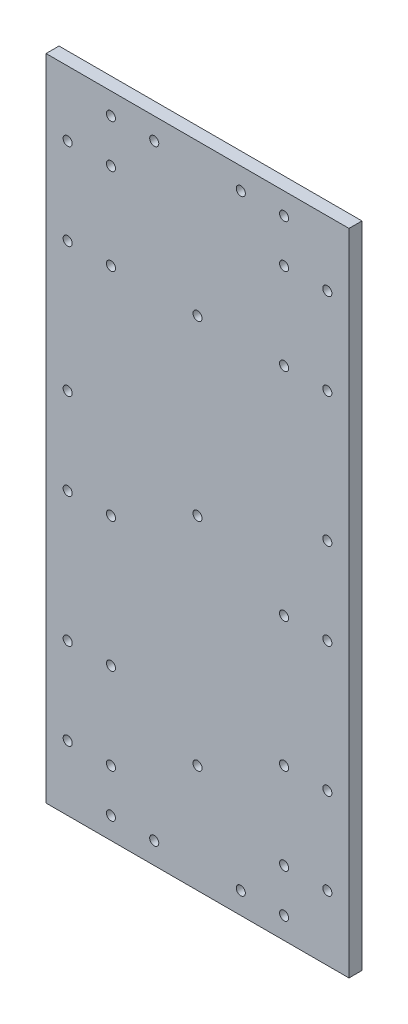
ISO-10303-21;
HEADER;
FILE_DESCRIPTION(('STEP AP214'),'2;1');
FILE_NAME('part.step','',(''),(''),'','','');
FILE_SCHEMA(('AUTOMOTIVE_DESIGN { 1 0 10303 214 1 1 1 1 }'));
ENDSEC;
DATA;
#1=APPLICATION_CONTEXT('core data for automotive mechanical design processes');
#2=APPLICATION_PROTOCOL_DEFINITION('international standard','automotive_design',2000,#1);
#3=PRODUCT_CONTEXT('',#1,'mechanical');
#4=PRODUCT('Part','Part','',(#3));
#5=PRODUCT_RELATED_PRODUCT_CATEGORY('part','',(#4));
#6=PRODUCT_DEFINITION_FORMATION('','',#4);
#7=PRODUCT_DEFINITION_CONTEXT('part definition',#1,'design');
#8=PRODUCT_DEFINITION('design','',#6,#7);
#9=PRODUCT_DEFINITION_SHAPE('','',#8);
#10=(LENGTH_UNIT() NAMED_UNIT(*) SI_UNIT(.MILLI.,.METRE.));
#11=(NAMED_UNIT(*) PLANE_ANGLE_UNIT() SI_UNIT($,.RADIAN.));
#12=(NAMED_UNIT(*) SI_UNIT($,.STERADIAN.) SOLID_ANGLE_UNIT());
#13=UNCERTAINTY_MEASURE_WITH_UNIT(LENGTH_MEASURE(1.E-05),#10,'distance_accuracy_value','');
#14=(GEOMETRIC_REPRESENTATION_CONTEXT(3) GLOBAL_UNCERTAINTY_ASSIGNED_CONTEXT((#13)) GLOBAL_UNIT_ASSIGNED_CONTEXT((#10,
#11,#12)) REPRESENTATION_CONTEXT('',''));
#15=CARTESIAN_POINT('',(0.,0.,0.));
#16=DIRECTION('',(0.,0.,1.));
#17=DIRECTION('',(1.,0.,0.));
#18=AXIS2_PLACEMENT_3D('',#15,#16,#17);
#19=CARTESIAN_POINT('',(0.,0.,6.));
#20=DIRECTION('',(0.,0.,-1.));
#21=DIRECTION('',(-1.,0.,0.));
#22=AXIS2_PLACEMENT_3D('',#19,#20,#21);
#23=PLANE('',#22);
#24=CARTESIAN_POINT('',(89.999999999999,289.999999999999,6.));
#25=DIRECTION('',(0.,0.,1.));
#26=DIRECTION('',(1.,0.,0.));
#27=AXIS2_PLACEMENT_3D('',#24,#25,#26);
#28=CIRCLE('',#27,2.1);
#29=CARTESIAN_POINT('',(92.099999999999,289.999999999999,6.));
#30=VERTEX_POINT('',#29);
#31=EDGE_CURVE('E274',#30,#30,#28,.T.);
#32=ORIENTED_EDGE('',*,*,#31,.F.);
#33=EDGE_LOOP('',(#32));
#34=FACE_BOUND('',#33,.T.);
#35=CARTESIAN_POINT('',(129.999999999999,270.,6.));
#36=DIRECTION('',(0.,0.,1.));
#37=DIRECTION('',(1.,0.,0.));
#38=AXIS2_PLACEMENT_3D('',#35,#36,#37);
#39=CIRCLE('',#38,2.09999999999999);
#40=CARTESIAN_POINT('',(132.099999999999,270.,6.));
#41=VERTEX_POINT('',#40);
#42=EDGE_CURVE('E276',#41,#41,#39,.T.);
#43=ORIENTED_EDGE('',*,*,#42,.F.);
#44=EDGE_LOOP('',(#43));
#45=FACE_BOUND('',#44,.T.);
#46=CARTESIAN_POINT('',(109.999999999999,270.,6.));
#47=DIRECTION('',(0.,0.,1.));
#48=DIRECTION('',(1.,0.,0.));
#49=AXIS2_PLACEMENT_3D('',#46,#47,#48);
#50=CIRCLE('',#49,2.1);
#51=CARTESIAN_POINT('',(112.099999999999,270.,6.));
#52=VERTEX_POINT('',#51);
#53=EDGE_CURVE('E284',#52,#52,#50,.T.);
#54=ORIENTED_EDGE('',*,*,#53,.F.);
#55=EDGE_LOOP('',(#54));
#56=FACE_BOUND('',#55,.T.);
#57=CARTESIAN_POINT('',(129.999999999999,230.,6.));
#58=DIRECTION('',(0.,0.,1.));
#59=DIRECTION('',(1.,0.,0.));
#60=AXIS2_PLACEMENT_3D('',#57,#58,#59);
#61=CIRCLE('',#60,2.09999999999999);
#62=CARTESIAN_POINT('',(132.099999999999,230.,6.));
#63=VERTEX_POINT('',#62);
#64=EDGE_CURVE('E296',#63,#63,#61,.T.);
#65=ORIENTED_EDGE('',*,*,#64,.F.);
#66=EDGE_LOOP('',(#65));
#67=FACE_BOUND('',#66,.T.);
#68=CARTESIAN_POINT('',(29.9999999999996,130.,6.));
#69=DIRECTION('',(0.,0.,1.));
#70=DIRECTION('',(1.,0.,0.));
#71=AXIS2_PLACEMENT_3D('',#68,#69,#70);
#72=CIRCLE('',#71,2.1);
#73=CARTESIAN_POINT('',(32.0999999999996,130.,6.));
#74=VERTEX_POINT('',#73);
#75=EDGE_CURVE('E308',#74,#74,#72,.T.);
#76=ORIENTED_EDGE('',*,*,#75,.F.);
#77=EDGE_LOOP('',(#76));
#78=FACE_BOUND('',#77,.T.);
#79=CARTESIAN_POINT('',(110.,130.,6.));
#80=DIRECTION('',(0.,0.,1.));
#81=DIRECTION('',(1.,0.,0.));
#82=AXIS2_PLACEMENT_3D('',#79,#80,#81);
#83=CIRCLE('',#82,2.1);
#84=CARTESIAN_POINT('',(112.1,130.,6.));
#85=VERTEX_POINT('',#84);
#86=EDGE_CURVE('E314',#85,#85,#83,.T.);
#87=ORIENTED_EDGE('',*,*,#86,.F.);
#88=EDGE_LOOP('',(#87));
#89=FACE_BOUND('',#88,.T.);
#90=CARTESIAN_POINT('',(9.99999999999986,70.,6.));
#91=DIRECTION('',(0.,0.,1.));
#92=DIRECTION('',(1.,0.,0.));
#93=AXIS2_PLACEMENT_3D('',#90,#91,#92);
#94=CIRCLE('',#93,2.1);
#95=CARTESIAN_POINT('',(12.0999999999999,70.,6.));
#96=VERTEX_POINT('',#95);
#97=EDGE_CURVE('E320',#96,#96,#94,.T.);
#98=ORIENTED_EDGE('',*,*,#97,.F.);
#99=EDGE_LOOP('',(#98));
#100=FACE_BOUND('',#99,.T.);
#101=CARTESIAN_POINT('',(130.,70.,6.));
#102=DIRECTION('',(0.,0.,1.));
#103=DIRECTION('',(1.,0.,0.));
#104=AXIS2_PLACEMENT_3D('',#101,#102,#103);
#105=CIRCLE('',#104,2.09999999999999);
#106=CARTESIAN_POINT('',(132.1,70.,6.));
#107=VERTEX_POINT('',#106);
#108=EDGE_CURVE('E326',#107,#107,#105,.T.);
#109=ORIENTED_EDGE('',*,*,#108,.F.);
#110=EDGE_LOOP('',(#109));
#111=FACE_BOUND('',#110,.T.);
#112=CARTESIAN_POINT('',(69.9999999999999,50.,6.));
#113=DIRECTION('',(0.,0.,1.));
#114=DIRECTION('',(1.,0.,0.));
#115=AXIS2_PLACEMENT_3D('',#112,#113,#114);
#116=CIRCLE('',#115,2.1);
#117=CARTESIAN_POINT('',(72.0999999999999,50.,6.));
#118=VERTEX_POINT('',#117);
#119=EDGE_CURVE('E332',#118,#118,#116,.T.);
#120=ORIENTED_EDGE('',*,*,#119,.F.);
#121=EDGE_LOOP('',(#120));
#122=FACE_BOUND('',#121,.T.);
#123=CARTESIAN_POINT('',(10.,30.,6.));
#124=DIRECTION('',(0.,0.,1.));
#125=DIRECTION('',(1.,0.,0.));
#126=AXIS2_PLACEMENT_3D('',#123,#124,#125);
#127=CIRCLE('',#126,2.1);
#128=CARTESIAN_POINT('',(12.1,30.,6.));
#129=VERTEX_POINT('',#128);
#130=EDGE_CURVE('E338',#129,#129,#127,.T.);
#131=ORIENTED_EDGE('',*,*,#130,.F.);
#132=EDGE_LOOP('',(#131));
#133=FACE_BOUND('',#132,.T.);
#134=CARTESIAN_POINT('',(130.,30.,6.));
#135=DIRECTION('',(0.,0.,1.));
#136=DIRECTION('',(1.,0.,0.));
#137=AXIS2_PLACEMENT_3D('',#134,#135,#136);
#138=CIRCLE('',#137,2.09999999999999);
#139=CARTESIAN_POINT('',(132.1,30.,6.));
#140=VERTEX_POINT('',#139);
#141=EDGE_CURVE('E344',#140,#140,#138,.T.);
#142=ORIENTED_EDGE('',*,*,#141,.F.);
#143=EDGE_LOOP('',(#142));
#144=FACE_BOUND('',#143,.T.);
#145=CARTESIAN_POINT('',(110.,10.,6.));
#146=DIRECTION('',(0.,0.,1.));
#147=DIRECTION('',(1.,0.,0.));
#148=AXIS2_PLACEMENT_3D('',#145,#146,#147);
#149=CIRCLE('',#148,2.1);
#150=CARTESIAN_POINT('',(112.1,10.,6.));
#151=VERTEX_POINT('',#150);
#152=EDGE_CURVE('E350',#151,#151,#149,.T.);
#153=ORIENTED_EDGE('',*,*,#152,.F.);
#154=EDGE_LOOP('',(#153));
#155=FACE_BOUND('',#154,.T.);
#156=CARTESIAN_POINT('',(49.9999999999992,289.999999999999,6.));
#157=DIRECTION('',(0.,0.,1.));
#158=DIRECTION('',(1.,0.,0.));
#159=AXIS2_PLACEMENT_3D('',#156,#157,#158);
#160=CIRCLE('',#159,2.1);
#161=CARTESIAN_POINT('',(52.0999999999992,289.999999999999,6.));
#162=VERTEX_POINT('',#161);
#163=EDGE_CURVE('E356',#162,#162,#160,.T.);
#164=ORIENTED_EDGE('',*,*,#163,.F.);
#165=EDGE_LOOP('',(#164));
#166=FACE_BOUND('',#165,.T.);
#167=CARTESIAN_POINT('',(29.9999999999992,230.,6.));
#168=DIRECTION('',(0.,0.,1.));
#169=DIRECTION('',(1.,0.,0.));
#170=AXIS2_PLACEMENT_3D('',#167,#168,#169);
#171=CIRCLE('',#170,2.1);
#172=CARTESIAN_POINT('',(32.0999999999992,230.,6.));
#173=VERTEX_POINT('',#172);
#174=EDGE_CURVE('E362',#173,#173,#171,.T.);
#175=ORIENTED_EDGE('',*,*,#174,.F.);
#176=EDGE_LOOP('',(#175));
#177=FACE_BOUND('',#176,.T.);
#178=CARTESIAN_POINT('',(130.,170.,6.));
#179=DIRECTION('',(0.,0.,1.));
#180=DIRECTION('',(1.,0.,0.));
#181=AXIS2_PLACEMENT_3D('',#178,#179,#180);
#182=CIRCLE('',#181,2.09999999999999);
#183=CARTESIAN_POINT('',(132.1,170.,6.));
#184=VERTEX_POINT('',#183);
#185=EDGE_CURVE('E368',#184,#184,#182,.T.);
#186=ORIENTED_EDGE('',*,*,#185,.F.);
#187=EDGE_LOOP('',(#186));
#188=FACE_BOUND('',#187,.T.);
#189=CARTESIAN_POINT('',(130.,130.,6.));
#190=DIRECTION('',(0.,0.,1.));
#191=DIRECTION('',(1.,0.,0.));
#192=AXIS2_PLACEMENT_3D('',#189,#190,#191);
#193=CIRCLE('',#192,2.09999999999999);
#194=CARTESIAN_POINT('',(132.1,130.,6.));
#195=VERTEX_POINT('',#194);
#196=EDGE_CURVE('E374',#195,#195,#193,.T.);
#197=ORIENTED_EDGE('',*,*,#196,.F.);
#198=EDGE_LOOP('',(#197));
#199=FACE_BOUND('',#198,.T.);
#200=CARTESIAN_POINT('',(9.99999999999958,130.,6.));
#201=DIRECTION('',(0.,0.,1.));
#202=DIRECTION('',(1.,0.,0.));
#203=AXIS2_PLACEMENT_3D('',#200,#201,#202);
#204=CIRCLE('',#203,2.1);
#205=CARTESIAN_POINT('',(12.0999999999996,130.,6.));
#206=VERTEX_POINT('',#205);
#207=EDGE_CURVE('E380',#206,#206,#204,.T.);
#208=ORIENTED_EDGE('',*,*,#207,.F.);
#209=EDGE_LOOP('',(#208));
#210=FACE_BOUND('',#209,.T.);
#211=CARTESIAN_POINT('',(9.99999999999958,170.,6.));
#212=DIRECTION('',(0.,0.,1.));
#213=DIRECTION('',(1.,0.,0.));
#214=AXIS2_PLACEMENT_3D('',#211,#212,#213);
#215=CIRCLE('',#214,2.1);
#216=CARTESIAN_POINT('',(12.0999999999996,170.,6.));
#217=VERTEX_POINT('',#216);
#218=EDGE_CURVE('E386',#217,#217,#215,.T.);
#219=ORIENTED_EDGE('',*,*,#218,.F.);
#220=EDGE_LOOP('',(#219));
#221=FACE_BOUND('',#220,.T.);
#222=CARTESIAN_POINT('',(29.9999999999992,289.999999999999,6.));
#223=DIRECTION('',(0.,0.,1.));
#224=DIRECTION('',(1.,0.,0.));
#225=AXIS2_PLACEMENT_3D('',#222,#223,#224);
#226=CIRCLE('',#225,2.1);
#227=CARTESIAN_POINT('',(32.0999999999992,289.999999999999,6.));
#228=VERTEX_POINT('',#227);
#229=EDGE_CURVE('E392',#228,#228,#226,.T.);
#230=ORIENTED_EDGE('',*,*,#229,.F.);
#231=EDGE_LOOP('',(#230));
#232=FACE_BOUND('',#231,.T.);
#233=CARTESIAN_POINT('',(109.999999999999,289.999999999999,6.));
#234=DIRECTION('',(0.,0.,1.));
#235=DIRECTION('',(1.,0.,0.));
#236=AXIS2_PLACEMENT_3D('',#233,#234,#235);
#237=CIRCLE('',#236,2.1);
#238=CARTESIAN_POINT('',(112.099999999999,289.999999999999,6.));
#239=VERTEX_POINT('',#238);
#240=EDGE_CURVE('E398',#239,#239,#237,.T.);
#241=ORIENTED_EDGE('',*,*,#240,.F.);
#242=EDGE_LOOP('',(#241));
#243=FACE_BOUND('',#242,.T.);
#244=CARTESIAN_POINT('',(89.9999999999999,10.,6.));
#245=DIRECTION('',(0.,0.,1.));
#246=DIRECTION('',(1.,0.,0.));
#247=AXIS2_PLACEMENT_3D('',#244,#245,#246);
#248=CIRCLE('',#247,2.1);
#249=CARTESIAN_POINT('',(92.0999999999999,10.,6.));
#250=VERTEX_POINT('',#249);
#251=EDGE_CURVE('E404',#250,#250,#248,.T.);
#252=ORIENTED_EDGE('',*,*,#251,.F.);
#253=EDGE_LOOP('',(#252));
#254=FACE_BOUND('',#253,.T.);
#255=CARTESIAN_POINT('',(50.,10.,6.));
#256=DIRECTION('',(0.,0.,1.));
#257=DIRECTION('',(1.,0.,0.));
#258=AXIS2_PLACEMENT_3D('',#255,#256,#257);
#259=CIRCLE('',#258,2.1);
#260=CARTESIAN_POINT('',(52.1,10.,6.));
#261=VERTEX_POINT('',#260);
#262=EDGE_CURVE('E410',#261,#261,#259,.T.);
#263=ORIENTED_EDGE('',*,*,#262,.F.);
#264=EDGE_LOOP('',(#263));
#265=FACE_BOUND('',#264,.T.);
#266=CARTESIAN_POINT('',(29.9999999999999,10.,6.));
#267=DIRECTION('',(0.,0.,1.));
#268=DIRECTION('',(1.,0.,0.));
#269=AXIS2_PLACEMENT_3D('',#266,#267,#268);
#270=CIRCLE('',#269,2.1);
#271=CARTESIAN_POINT('',(32.0999999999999,10.,6.));
#272=VERTEX_POINT('',#271);
#273=EDGE_CURVE('E416',#272,#272,#270,.T.);
#274=ORIENTED_EDGE('',*,*,#273,.F.);
#275=EDGE_LOOP('',(#274));
#276=FACE_BOUND('',#275,.T.);
#277=CARTESIAN_POINT('',(110.,29.9999999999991,6.));
#278=DIRECTION('',(0.,0.,1.));
#279=DIRECTION('',(1.,0.,0.));
#280=AXIS2_PLACEMENT_3D('',#277,#278,#279);
#281=CIRCLE('',#280,2.1);
#282=CARTESIAN_POINT('',(112.1,29.9999999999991,6.));
#283=VERTEX_POINT('',#282);
#284=EDGE_CURVE('E422',#283,#283,#281,.T.);
#285=ORIENTED_EDGE('',*,*,#284,.F.);
#286=EDGE_LOOP('',(#285));
#287=FACE_BOUND('',#286,.T.);
#288=CARTESIAN_POINT('',(110.,70.,6.));
#289=DIRECTION('',(0.,0.,1.));
#290=DIRECTION('',(1.,0.,0.));
#291=AXIS2_PLACEMENT_3D('',#288,#289,#290);
#292=CIRCLE('',#291,2.1);
#293=CARTESIAN_POINT('',(112.1,70.,6.));
#294=VERTEX_POINT('',#293);
#295=EDGE_CURVE('E428',#294,#294,#292,.T.);
#296=ORIENTED_EDGE('',*,*,#295,.F.);
#297=EDGE_LOOP('',(#296));
#298=FACE_BOUND('',#297,.T.);
#299=CARTESIAN_POINT('',(29.9999999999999,70.,6.));
#300=DIRECTION('',(0.,0.,1.));
#301=DIRECTION('',(1.,0.,0.));
#302=AXIS2_PLACEMENT_3D('',#299,#300,#301);
#303=CIRCLE('',#302,2.1);
#304=CARTESIAN_POINT('',(32.0999999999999,70.,6.));
#305=VERTEX_POINT('',#304);
#306=EDGE_CURVE('E434',#305,#305,#303,.T.);
#307=ORIENTED_EDGE('',*,*,#306,.F.);
#308=EDGE_LOOP('',(#307));
#309=FACE_BOUND('',#308,.T.);
#310=CARTESIAN_POINT('',(29.9999999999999,30.,6.));
#311=DIRECTION('',(0.,0.,1.));
#312=DIRECTION('',(1.,0.,0.));
#313=AXIS2_PLACEMENT_3D('',#310,#311,#312);
#314=CIRCLE('',#313,2.1);
#315=CARTESIAN_POINT('',(32.0999999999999,30.,6.));
#316=VERTEX_POINT('',#315);
#317=EDGE_CURVE('E440',#316,#316,#314,.T.);
#318=ORIENTED_EDGE('',*,*,#317,.F.);
#319=EDGE_LOOP('',(#318));
#320=FACE_BOUND('',#319,.T.);
#321=CARTESIAN_POINT('',(69.9999999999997,230.,6.));
#322=DIRECTION('',(0.,0.,1.));
#323=DIRECTION('',(1.,0.,0.));
#324=AXIS2_PLACEMENT_3D('',#321,#322,#323);
#325=CIRCLE('',#324,2.1);
#326=CARTESIAN_POINT('',(72.0999999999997,230.,6.));
#327=VERTEX_POINT('',#326);
#328=EDGE_CURVE('E446',#327,#327,#325,.T.);
#329=ORIENTED_EDGE('',*,*,#328,.F.);
#330=EDGE_LOOP('',(#329));
#331=FACE_BOUND('',#330,.T.);
#332=CARTESIAN_POINT('',(69.9999999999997,150.,6.));
#333=DIRECTION('',(0.,0.,1.));
#334=DIRECTION('',(1.,0.,0.));
#335=AXIS2_PLACEMENT_3D('',#332,#333,#334);
#336=CIRCLE('',#335,2.1);
#337=CARTESIAN_POINT('',(72.0999999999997,150.,6.));
#338=VERTEX_POINT('',#337);
#339=EDGE_CURVE('E452',#338,#338,#336,.T.);
#340=ORIENTED_EDGE('',*,*,#339,.F.);
#341=EDGE_LOOP('',(#340));
#342=FACE_BOUND('',#341,.T.);
#343=CARTESIAN_POINT('',(9.99999999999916,270.,6.));
#344=DIRECTION('',(0.,0.,1.));
#345=DIRECTION('',(1.,0.,0.));
#346=AXIS2_PLACEMENT_3D('',#343,#344,#345);
#347=CIRCLE('',#346,2.1);
#348=CARTESIAN_POINT('',(12.0999999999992,270.,6.));
#349=VERTEX_POINT('',#348);
#350=EDGE_CURVE('E458',#349,#349,#347,.T.);
#351=ORIENTED_EDGE('',*,*,#350,.F.);
#352=EDGE_LOOP('',(#351));
#353=FACE_BOUND('',#352,.T.);
#354=CARTESIAN_POINT('',(9.9999999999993,230.,6.));
#355=DIRECTION('',(0.,0.,1.));
#356=DIRECTION('',(1.,0.,0.));
#357=AXIS2_PLACEMENT_3D('',#354,#355,#356);
#358=CIRCLE('',#357,2.1);
#359=CARTESIAN_POINT('',(12.0999999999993,230.,6.));
#360=VERTEX_POINT('',#359);
#361=EDGE_CURVE('E464',#360,#360,#358,.T.);
#362=ORIENTED_EDGE('',*,*,#361,.F.);
#363=EDGE_LOOP('',(#362));
#364=FACE_BOUND('',#363,.T.);
#365=DIRECTION('',(-1.,0.,0.));
#366=VECTOR('',#365,1.);
#367=CARTESIAN_POINT('',(140.,0.,6.));
#368=LINE('',#367,#366);
#369=CARTESIAN_POINT('',(140.,0.,6.));
#370=VERTEX_POINT('',#369);
#371=CARTESIAN_POINT('',(0.,0.,6.));
#372=VERTEX_POINT('',#371);
#373=EDGE_CURVE('E98',#370,#372,#368,.T.);
#374=ORIENTED_EDGE('',*,*,#373,.F.);
#375=DIRECTION('',(0.,-1.,0.));
#376=VECTOR('',#375,1.);
#377=CARTESIAN_POINT('',(140.,300.,6.));
#378=LINE('',#377,#376);
#379=CARTESIAN_POINT('',(140.,300.,6.));
#380=VERTEX_POINT('',#379);
#381=EDGE_CURVE('E95',#380,#370,#378,.T.);
#382=ORIENTED_EDGE('',*,*,#381,.F.);
#383=DIRECTION('',(1.,0.,0.));
#384=VECTOR('',#383,1.);
#385=CARTESIAN_POINT('',(0.,300.,6.));
#386=LINE('',#385,#384);
#387=CARTESIAN_POINT('',(0.,300.,6.));
#388=VERTEX_POINT('',#387);
#389=EDGE_CURVE('E88',#388,#380,#386,.T.);
#390=ORIENTED_EDGE('',*,*,#389,.F.);
#391=DIRECTION('',(0.,1.,0.));
#392=VECTOR('',#391,1.);
#393=CARTESIAN_POINT('',(0.,0.,6.));
#394=LINE('',#393,#392);
#395=EDGE_CURVE('E94',#372,#388,#394,.T.);
#396=ORIENTED_EDGE('',*,*,#395,.F.);
#397=EDGE_LOOP('',(#374,#382,#390,#396));
#398=FACE_BOUND('',#397,.T.);
#399=CARTESIAN_POINT('',(109.999999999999,230.,6.));
#400=DIRECTION('',(0.,0.,1.));
#401=DIRECTION('',(1.,0.,0.));
#402=AXIS2_PLACEMENT_3D('',#399,#400,#401);
#403=CIRCLE('',#402,2.1);
#404=CARTESIAN_POINT('',(112.099999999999,230.,6.));
#405=VERTEX_POINT('',#404);
#406=EDGE_CURVE('E302',#405,#405,#403,.T.);
#407=ORIENTED_EDGE('',*,*,#406,.F.);
#408=EDGE_LOOP('',(#407));
#409=FACE_BOUND('',#408,.T.);
#410=CARTESIAN_POINT('',(29.9999999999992,270.,6.));
#411=DIRECTION('',(0.,0.,1.));
#412=DIRECTION('',(1.,0.,0.));
#413=AXIS2_PLACEMENT_3D('',#410,#411,#412);
#414=CIRCLE('',#413,2.1);
#415=CARTESIAN_POINT('',(32.0999999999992,270.,6.));
#416=VERTEX_POINT('',#415);
#417=EDGE_CURVE('E290',#416,#416,#414,.T.);
#418=ORIENTED_EDGE('',*,*,#417,.F.);
#419=EDGE_LOOP('',(#418));
#420=FACE_BOUND('',#419,.T.);
#421=ADVANCED_FACE('F39',(#34,#45,#56,#67,#78,#89,#100,#111,#122,#133,#144,#155,#166,#177,#188,
#199,#210,#221,#232,#243,#254,#265,#276,#287,#298,#309,#320,#331,#342,#353,#364,#398,#409,#420),
#23,.F.);
#422=CARTESIAN_POINT('',(0.,0.,0.));
#423=DIRECTION('',(0.,0.,-1.));
#424=DIRECTION('',(-1.,0.,0.));
#425=AXIS2_PLACEMENT_3D('',#422,#423,#424);
#426=PLANE('',#425);
#427=CARTESIAN_POINT('',(89.999999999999,289.999999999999,0.));
#428=DIRECTION('',(0.,0.,1.));
#429=DIRECTION('',(1.,0.,0.));
#430=AXIS2_PLACEMENT_3D('',#427,#428,#429);
#431=CIRCLE('',#430,2.1);
#432=CARTESIAN_POINT('',(92.099999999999,289.999999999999,0.));
#433=VERTEX_POINT('',#432);
#434=EDGE_CURVE('E272',#433,#433,#431,.T.);
#435=ORIENTED_EDGE('',*,*,#434,.T.);
#436=EDGE_LOOP('',(#435));
#437=FACE_BOUND('',#436,.T.);
#438=CARTESIAN_POINT('',(129.999999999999,270.,0.));
#439=DIRECTION('',(0.,0.,1.));
#440=DIRECTION('',(1.,0.,0.));
#441=AXIS2_PLACEMENT_3D('',#438,#439,#440);
#442=CIRCLE('',#441,2.09999999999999);
#443=CARTESIAN_POINT('',(132.099999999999,270.,0.));
#444=VERTEX_POINT('',#443);
#445=EDGE_CURVE('E281',#444,#444,#442,.T.);
#446=ORIENTED_EDGE('',*,*,#445,.T.);
#447=EDGE_LOOP('',(#446));
#448=FACE_BOUND('',#447,.T.);
#449=CARTESIAN_POINT('',(109.999999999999,270.,0.));
#450=DIRECTION('',(0.,0.,1.));
#451=DIRECTION('',(1.,0.,0.));
#452=AXIS2_PLACEMENT_3D('',#449,#450,#451);
#453=CIRCLE('',#452,2.1);
#454=CARTESIAN_POINT('',(112.099999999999,270.,0.));
#455=VERTEX_POINT('',#454);
#456=EDGE_CURVE('E287',#455,#455,#453,.T.);
#457=ORIENTED_EDGE('',*,*,#456,.T.);
#458=EDGE_LOOP('',(#457));
#459=FACE_BOUND('',#458,.T.);
#460=CARTESIAN_POINT('',(29.9999999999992,270.,0.));
#461=DIRECTION('',(0.,0.,1.));
#462=DIRECTION('',(1.,0.,0.));
#463=AXIS2_PLACEMENT_3D('',#460,#461,#462);
#464=CIRCLE('',#463,2.1);
#465=CARTESIAN_POINT('',(32.0999999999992,270.,0.));
#466=VERTEX_POINT('',#465);
#467=EDGE_CURVE('E293',#466,#466,#464,.T.);
#468=ORIENTED_EDGE('',*,*,#467,.T.);
#469=EDGE_LOOP('',(#468));
#470=FACE_BOUND('',#469,.T.);
#471=CARTESIAN_POINT('',(129.999999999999,230.,0.));
#472=DIRECTION('',(0.,0.,1.));
#473=DIRECTION('',(1.,0.,0.));
#474=AXIS2_PLACEMENT_3D('',#471,#472,#473);
#475=CIRCLE('',#474,2.09999999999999);
#476=CARTESIAN_POINT('',(132.099999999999,230.,0.));
#477=VERTEX_POINT('',#476);
#478=EDGE_CURVE('E299',#477,#477,#475,.T.);
#479=ORIENTED_EDGE('',*,*,#478,.T.);
#480=EDGE_LOOP('',(#479));
#481=FACE_BOUND('',#480,.T.);
#482=CARTESIAN_POINT('',(89.9999999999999,10.,0.));
#483=DIRECTION('',(0.,0.,1.));
#484=DIRECTION('',(1.,0.,0.));
#485=AXIS2_PLACEMENT_3D('',#482,#483,#484);
#486=CIRCLE('',#485,2.1);
#487=CARTESIAN_POINT('',(92.0999999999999,10.,0.));
#488=VERTEX_POINT('',#487);
#489=EDGE_CURVE('E407',#488,#488,#486,.T.);
#490=ORIENTED_EDGE('',*,*,#489,.T.);
#491=EDGE_LOOP('',(#490));
#492=FACE_BOUND('',#491,.T.);
#493=CARTESIAN_POINT('',(50.,10.,0.));
#494=DIRECTION('',(0.,0.,1.));
#495=DIRECTION('',(1.,0.,0.));
#496=AXIS2_PLACEMENT_3D('',#493,#494,#495);
#497=CIRCLE('',#496,2.1);
#498=CARTESIAN_POINT('',(52.1,10.,0.));
#499=VERTEX_POINT('',#498);
#500=EDGE_CURVE('E413',#499,#499,#497,.T.);
#501=ORIENTED_EDGE('',*,*,#500,.T.);
#502=EDGE_LOOP('',(#501));
#503=FACE_BOUND('',#502,.T.);
#504=CARTESIAN_POINT('',(29.9999999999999,10.,0.));
#505=DIRECTION('',(0.,0.,1.));
#506=DIRECTION('',(1.,0.,0.));
#507=AXIS2_PLACEMENT_3D('',#504,#505,#506);
#508=CIRCLE('',#507,2.1);
#509=CARTESIAN_POINT('',(32.0999999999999,10.,0.));
#510=VERTEX_POINT('',#509);
#511=EDGE_CURVE('E419',#510,#510,#508,.T.);
#512=ORIENTED_EDGE('',*,*,#511,.T.);
#513=EDGE_LOOP('',(#512));
#514=FACE_BOUND('',#513,.T.);
#515=CARTESIAN_POINT('',(110.,29.9999999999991,0.));
#516=DIRECTION('',(0.,0.,1.));
#517=DIRECTION('',(1.,0.,0.));
#518=AXIS2_PLACEMENT_3D('',#515,#516,#517);
#519=CIRCLE('',#518,2.1);
#520=CARTESIAN_POINT('',(112.1,29.9999999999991,0.));
#521=VERTEX_POINT('',#520);
#522=EDGE_CURVE('E425',#521,#521,#519,.T.);
#523=ORIENTED_EDGE('',*,*,#522,.T.);
#524=EDGE_LOOP('',(#523));
#525=FACE_BOUND('',#524,.T.);
#526=CARTESIAN_POINT('',(110.,70.,0.));
#527=DIRECTION('',(0.,0.,1.));
#528=DIRECTION('',(1.,0.,0.));
#529=AXIS2_PLACEMENT_3D('',#526,#527,#528);
#530=CIRCLE('',#529,2.1);
#531=CARTESIAN_POINT('',(112.1,70.,0.));
#532=VERTEX_POINT('',#531);
#533=EDGE_CURVE('E431',#532,#532,#530,.T.);
#534=ORIENTED_EDGE('',*,*,#533,.T.);
#535=EDGE_LOOP('',(#534));
#536=FACE_BOUND('',#535,.T.);
#537=CARTESIAN_POINT('',(29.9999999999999,70.,0.));
#538=DIRECTION('',(0.,0.,1.));
#539=DIRECTION('',(1.,0.,0.));
#540=AXIS2_PLACEMENT_3D('',#537,#538,#539);
#541=CIRCLE('',#540,2.1);
#542=CARTESIAN_POINT('',(32.0999999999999,70.,0.));
#543=VERTEX_POINT('',#542);
#544=EDGE_CURVE('E437',#543,#543,#541,.T.);
#545=ORIENTED_EDGE('',*,*,#544,.T.);
#546=EDGE_LOOP('',(#545));
#547=FACE_BOUND('',#546,.T.);
#548=CARTESIAN_POINT('',(29.9999999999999,30.,0.));
#549=DIRECTION('',(0.,0.,1.));
#550=DIRECTION('',(1.,0.,0.));
#551=AXIS2_PLACEMENT_3D('',#548,#549,#550);
#552=CIRCLE('',#551,2.1);
#553=CARTESIAN_POINT('',(32.0999999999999,30.,0.));
#554=VERTEX_POINT('',#553);
#555=EDGE_CURVE('E443',#554,#554,#552,.T.);
#556=ORIENTED_EDGE('',*,*,#555,.T.);
#557=EDGE_LOOP('',(#556));
#558=FACE_BOUND('',#557,.T.);
#559=CARTESIAN_POINT('',(69.9999999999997,230.,0.));
#560=DIRECTION('',(0.,0.,1.));
#561=DIRECTION('',(1.,0.,0.));
#562=AXIS2_PLACEMENT_3D('',#559,#560,#561);
#563=CIRCLE('',#562,2.1);
#564=CARTESIAN_POINT('',(72.0999999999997,230.,0.));
#565=VERTEX_POINT('',#564);
#566=EDGE_CURVE('E449',#565,#565,#563,.T.);
#567=ORIENTED_EDGE('',*,*,#566,.T.);
#568=EDGE_LOOP('',(#567));
#569=FACE_BOUND('',#568,.T.);
#570=CARTESIAN_POINT('',(69.9999999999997,150.,0.));
#571=DIRECTION('',(0.,0.,1.));
#572=DIRECTION('',(1.,0.,0.));
#573=AXIS2_PLACEMENT_3D('',#570,#571,#572);
#574=CIRCLE('',#573,2.1);
#575=CARTESIAN_POINT('',(72.0999999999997,150.,0.));
#576=VERTEX_POINT('',#575);
#577=EDGE_CURVE('E455',#576,#576,#574,.T.);
#578=ORIENTED_EDGE('',*,*,#577,.T.);
#579=EDGE_LOOP('',(#578));
#580=FACE_BOUND('',#579,.T.);
#581=CARTESIAN_POINT('',(9.99999999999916,270.,0.));
#582=DIRECTION('',(0.,0.,1.));
#583=DIRECTION('',(1.,0.,0.));
#584=AXIS2_PLACEMENT_3D('',#581,#582,#583);
#585=CIRCLE('',#584,2.1);
#586=CARTESIAN_POINT('',(12.0999999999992,270.,0.));
#587=VERTEX_POINT('',#586);
#588=EDGE_CURVE('E461',#587,#587,#585,.T.);
#589=ORIENTED_EDGE('',*,*,#588,.T.);
#590=EDGE_LOOP('',(#589));
#591=FACE_BOUND('',#590,.T.);
#592=DIRECTION('',(-1.,0.,0.));
#593=VECTOR('',#592,1.);
#594=CARTESIAN_POINT('',(140.,0.,0.));
#595=LINE('',#594,#593);
#596=CARTESIAN_POINT('',(140.,0.,0.));
#597=VERTEX_POINT('',#596);
#598=CARTESIAN_POINT('',(0.,0.,0.));
#599=VERTEX_POINT('',#598);
#600=EDGE_CURVE('E105',#597,#599,#595,.T.);
#601=ORIENTED_EDGE('',*,*,#600,.T.);
#602=DIRECTION('',(0.,1.,0.));
#603=VECTOR('',#602,1.);
#604=CARTESIAN_POINT('',(0.,0.,0.));
#605=LINE('',#604,#603);
#606=CARTESIAN_POINT('',(0.,300.,0.));
#607=VERTEX_POINT('',#606);
#608=EDGE_CURVE('E108',#599,#607,#605,.T.);
#609=ORIENTED_EDGE('',*,*,#608,.T.);
#610=DIRECTION('',(1.,0.,0.));
#611=VECTOR('',#610,1.);
#612=CARTESIAN_POINT('',(0.,300.,0.));
#613=LINE('',#612,#611);
#614=CARTESIAN_POINT('',(140.,300.,0.));
#615=VERTEX_POINT('',#614);
#616=EDGE_CURVE('E90',#607,#615,#613,.T.);
#617=ORIENTED_EDGE('',*,*,#616,.T.);
#618=DIRECTION('',(0.,-1.,0.));
#619=VECTOR('',#618,1.);
#620=CARTESIAN_POINT('',(140.,300.,0.));
#621=LINE('',#620,#619);
#622=EDGE_CURVE('E100',#615,#597,#621,.T.);
#623=ORIENTED_EDGE('',*,*,#622,.T.);
#624=EDGE_LOOP('',(#601,#609,#617,#623));
#625=FACE_BOUND('',#624,.T.);
#626=CARTESIAN_POINT('',(9.9999999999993,230.,0.));
#627=DIRECTION('',(0.,0.,1.));
#628=DIRECTION('',(1.,0.,0.));
#629=AXIS2_PLACEMENT_3D('',#626,#627,#628);
#630=CIRCLE('',#629,2.1);
#631=CARTESIAN_POINT('',(12.0999999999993,230.,0.));
#632=VERTEX_POINT('',#631);
#633=EDGE_CURVE('E109',#632,#632,#630,.T.);
#634=ORIENTED_EDGE('',*,*,#633,.T.);
#635=EDGE_LOOP('',(#634));
#636=FACE_BOUND('',#635,.T.);
#637=CARTESIAN_POINT('',(109.999999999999,289.999999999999,0.));
#638=DIRECTION('',(0.,0.,1.));
#639=DIRECTION('',(1.,0.,0.));
#640=AXIS2_PLACEMENT_3D('',#637,#638,#639);
#641=CIRCLE('',#640,2.1);
#642=CARTESIAN_POINT('',(112.099999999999,289.999999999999,0.));
#643=VERTEX_POINT('',#642);
#644=EDGE_CURVE('E401',#643,#643,#641,.T.);
#645=ORIENTED_EDGE('',*,*,#644,.T.);
#646=EDGE_LOOP('',(#645));
#647=FACE_BOUND('',#646,.T.);
#648=CARTESIAN_POINT('',(29.9999999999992,289.999999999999,0.));
#649=DIRECTION('',(0.,0.,1.));
#650=DIRECTION('',(1.,0.,0.));
#651=AXIS2_PLACEMENT_3D('',#648,#649,#650);
#652=CIRCLE('',#651,2.1);
#653=CARTESIAN_POINT('',(32.0999999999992,289.999999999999,0.));
#654=VERTEX_POINT('',#653);
#655=EDGE_CURVE('E395',#654,#654,#652,.T.);
#656=ORIENTED_EDGE('',*,*,#655,.T.);
#657=EDGE_LOOP('',(#656));
#658=FACE_BOUND('',#657,.T.);
#659=CARTESIAN_POINT('',(9.99999999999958,170.,0.));
#660=DIRECTION('',(0.,0.,1.));
#661=DIRECTION('',(1.,0.,0.));
#662=AXIS2_PLACEMENT_3D('',#659,#660,#661);
#663=CIRCLE('',#662,2.1);
#664=CARTESIAN_POINT('',(12.0999999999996,170.,0.));
#665=VERTEX_POINT('',#664);
#666=EDGE_CURVE('E389',#665,#665,#663,.T.);
#667=ORIENTED_EDGE('',*,*,#666,.T.);
#668=EDGE_LOOP('',(#667));
#669=FACE_BOUND('',#668,.T.);
#670=CARTESIAN_POINT('',(9.99999999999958,130.,0.));
#671=DIRECTION('',(0.,0.,1.));
#672=DIRECTION('',(1.,0.,0.));
#673=AXIS2_PLACEMENT_3D('',#670,#671,#672);
#674=CIRCLE('',#673,2.1);
#675=CARTESIAN_POINT('',(12.0999999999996,130.,0.));
#676=VERTEX_POINT('',#675);
#677=EDGE_CURVE('E383',#676,#676,#674,.T.);
#678=ORIENTED_EDGE('',*,*,#677,.T.);
#679=EDGE_LOOP('',(#678));
#680=FACE_BOUND('',#679,.T.);
#681=CARTESIAN_POINT('',(130.,130.,0.));
#682=DIRECTION('',(0.,0.,1.));
#683=DIRECTION('',(1.,0.,0.));
#684=AXIS2_PLACEMENT_3D('',#681,#682,#683);
#685=CIRCLE('',#684,2.09999999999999);
#686=CARTESIAN_POINT('',(132.1,130.,0.));
#687=VERTEX_POINT('',#686);
#688=EDGE_CURVE('E377',#687,#687,#685,.T.);
#689=ORIENTED_EDGE('',*,*,#688,.T.);
#690=EDGE_LOOP('',(#689));
#691=FACE_BOUND('',#690,.T.);
#692=CARTESIAN_POINT('',(130.,170.,0.));
#693=DIRECTION('',(0.,0.,1.));
#694=DIRECTION('',(1.,0.,0.));
#695=AXIS2_PLACEMENT_3D('',#692,#693,#694);
#696=CIRCLE('',#695,2.09999999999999);
#697=CARTESIAN_POINT('',(132.1,170.,0.));
#698=VERTEX_POINT('',#697);
#699=EDGE_CURVE('E371',#698,#698,#696,.T.);
#700=ORIENTED_EDGE('',*,*,#699,.T.);
#701=EDGE_LOOP('',(#700));
#702=FACE_BOUND('',#701,.T.);
#703=CARTESIAN_POINT('',(29.9999999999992,230.,0.));
#704=DIRECTION('',(0.,0.,1.));
#705=DIRECTION('',(1.,0.,0.));
#706=AXIS2_PLACEMENT_3D('',#703,#704,#705);
#707=CIRCLE('',#706,2.1);
#708=CARTESIAN_POINT('',(32.0999999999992,230.,0.));
#709=VERTEX_POINT('',#708);
#710=EDGE_CURVE('E365',#709,#709,#707,.T.);
#711=ORIENTED_EDGE('',*,*,#710,.T.);
#712=EDGE_LOOP('',(#711));
#713=FACE_BOUND('',#712,.T.);
#714=CARTESIAN_POINT('',(49.9999999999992,289.999999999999,0.));
#715=DIRECTION('',(0.,0.,1.));
#716=DIRECTION('',(1.,0.,0.));
#717=AXIS2_PLACEMENT_3D('',#714,#715,#716);
#718=CIRCLE('',#717,2.1);
#719=CARTESIAN_POINT('',(52.0999999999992,289.999999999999,0.));
#720=VERTEX_POINT('',#719);
#721=EDGE_CURVE('E359',#720,#720,#718,.T.);
#722=ORIENTED_EDGE('',*,*,#721,.T.);
#723=EDGE_LOOP('',(#722));
#724=FACE_BOUND('',#723,.T.);
#725=CARTESIAN_POINT('',(110.,10.,0.));
#726=DIRECTION('',(0.,0.,1.));
#727=DIRECTION('',(1.,0.,0.));
#728=AXIS2_PLACEMENT_3D('',#725,#726,#727);
#729=CIRCLE('',#728,2.1);
#730=CARTESIAN_POINT('',(112.1,10.,0.));
#731=VERTEX_POINT('',#730);
#732=EDGE_CURVE('E353',#731,#731,#729,.T.);
#733=ORIENTED_EDGE('',*,*,#732,.T.);
#734=EDGE_LOOP('',(#733));
#735=FACE_BOUND('',#734,.T.);
#736=CARTESIAN_POINT('',(130.,30.,0.));
#737=DIRECTION('',(0.,0.,1.));
#738=DIRECTION('',(1.,0.,0.));
#739=AXIS2_PLACEMENT_3D('',#736,#737,#738);
#740=CIRCLE('',#739,2.09999999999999);
#741=CARTESIAN_POINT('',(132.1,30.,0.));
#742=VERTEX_POINT('',#741);
#743=EDGE_CURVE('E347',#742,#742,#740,.T.);
#744=ORIENTED_EDGE('',*,*,#743,.T.);
#745=EDGE_LOOP('',(#744));
#746=FACE_BOUND('',#745,.T.);
#747=CARTESIAN_POINT('',(10.,30.,0.));
#748=DIRECTION('',(0.,0.,1.));
#749=DIRECTION('',(1.,0.,0.));
#750=AXIS2_PLACEMENT_3D('',#747,#748,#749);
#751=CIRCLE('',#750,2.1);
#752=CARTESIAN_POINT('',(12.1,30.,0.));
#753=VERTEX_POINT('',#752);
#754=EDGE_CURVE('E341',#753,#753,#751,.T.);
#755=ORIENTED_EDGE('',*,*,#754,.T.);
#756=EDGE_LOOP('',(#755));
#757=FACE_BOUND('',#756,.T.);
#758=CARTESIAN_POINT('',(69.9999999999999,50.,0.));
#759=DIRECTION('',(0.,0.,1.));
#760=DIRECTION('',(1.,0.,0.));
#761=AXIS2_PLACEMENT_3D('',#758,#759,#760);
#762=CIRCLE('',#761,2.1);
#763=CARTESIAN_POINT('',(72.0999999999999,50.,0.));
#764=VERTEX_POINT('',#763);
#765=EDGE_CURVE('E335',#764,#764,#762,.T.);
#766=ORIENTED_EDGE('',*,*,#765,.T.);
#767=EDGE_LOOP('',(#766));
#768=FACE_BOUND('',#767,.T.);
#769=CARTESIAN_POINT('',(130.,70.,0.));
#770=DIRECTION('',(0.,0.,1.));
#771=DIRECTION('',(1.,0.,0.));
#772=AXIS2_PLACEMENT_3D('',#769,#770,#771);
#773=CIRCLE('',#772,2.09999999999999);
#774=CARTESIAN_POINT('',(132.1,70.,0.));
#775=VERTEX_POINT('',#774);
#776=EDGE_CURVE('E329',#775,#775,#773,.T.);
#777=ORIENTED_EDGE('',*,*,#776,.T.);
#778=EDGE_LOOP('',(#777));
#779=FACE_BOUND('',#778,.T.);
#780=CARTESIAN_POINT('',(9.99999999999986,70.,0.));
#781=DIRECTION('',(0.,0.,1.));
#782=DIRECTION('',(1.,0.,0.));
#783=AXIS2_PLACEMENT_3D('',#780,#781,#782);
#784=CIRCLE('',#783,2.1);
#785=CARTESIAN_POINT('',(12.0999999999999,70.,0.));
#786=VERTEX_POINT('',#785);
#787=EDGE_CURVE('E323',#786,#786,#784,.T.);
#788=ORIENTED_EDGE('',*,*,#787,.T.);
#789=EDGE_LOOP('',(#788));
#790=FACE_BOUND('',#789,.T.);
#791=CARTESIAN_POINT('',(110.,130.,0.));
#792=DIRECTION('',(0.,0.,1.));
#793=DIRECTION('',(1.,0.,0.));
#794=AXIS2_PLACEMENT_3D('',#791,#792,#793);
#795=CIRCLE('',#794,2.1);
#796=CARTESIAN_POINT('',(112.1,130.,0.));
#797=VERTEX_POINT('',#796);
#798=EDGE_CURVE('E317',#797,#797,#795,.T.);
#799=ORIENTED_EDGE('',*,*,#798,.T.);
#800=EDGE_LOOP('',(#799));
#801=FACE_BOUND('',#800,.T.);
#802=CARTESIAN_POINT('',(29.9999999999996,130.,0.));
#803=DIRECTION('',(0.,0.,1.));
#804=DIRECTION('',(1.,0.,0.));
#805=AXIS2_PLACEMENT_3D('',#802,#803,#804);
#806=CIRCLE('',#805,2.1);
#807=CARTESIAN_POINT('',(32.0999999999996,130.,0.));
#808=VERTEX_POINT('',#807);
#809=EDGE_CURVE('E311',#808,#808,#806,.T.);
#810=ORIENTED_EDGE('',*,*,#809,.T.);
#811=EDGE_LOOP('',(#810));
#812=FACE_BOUND('',#811,.T.);
#813=CARTESIAN_POINT('',(109.999999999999,230.,0.));
#814=DIRECTION('',(0.,0.,1.));
#815=DIRECTION('',(1.,0.,0.));
#816=AXIS2_PLACEMENT_3D('',#813,#814,#815);
#817=CIRCLE('',#816,2.1);
#818=CARTESIAN_POINT('',(112.099999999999,230.,0.));
#819=VERTEX_POINT('',#818);
#820=EDGE_CURVE('E305',#819,#819,#817,.T.);
#821=ORIENTED_EDGE('',*,*,#820,.T.);
#822=EDGE_LOOP('',(#821));
#823=FACE_BOUND('',#822,.T.);
#824=ADVANCED_FACE('F115',(#437,#448,#459,#470,#481,#492,#503,#514,#525,#536,#547,#558,#569,
#580,#591,#625,#636,#647,#658,#669,#680,#691,#702,#713,#724,#735,#746,#757,#768,#779,#790,#801,
#812,#823),#426,.T.);
#825=CARTESIAN_POINT('',(140.,0.,6.));
#826=DIRECTION('',(0.,-1.,0.));
#827=DIRECTION('',(0.,0.,-1.));
#828=AXIS2_PLACEMENT_3D('',#825,#826,#827);
#829=PLANE('',#828);
#830=ORIENTED_EDGE('',*,*,#600,.F.);
#831=DIRECTION('',(0.,0.,-1.));
#832=VECTOR('',#831,1.);
#833=CARTESIAN_POINT('',(140.,0.,6.));
#834=LINE('',#833,#832);
#835=EDGE_CURVE('E11',#370,#597,#834,.T.);
#836=ORIENTED_EDGE('',*,*,#835,.F.);
#837=ORIENTED_EDGE('',*,*,#373,.T.);
#838=DIRECTION('',(0.,0.,-1.));
#839=VECTOR('',#838,1.);
#840=CARTESIAN_POINT('',(0.,0.,6.));
#841=LINE('',#840,#839);
#842=EDGE_CURVE('E43',#372,#599,#841,.T.);
#843=ORIENTED_EDGE('',*,*,#842,.T.);
#844=EDGE_LOOP('',(#830,#836,#837,#843));
#845=FACE_BOUND('',#844,.T.);
#846=ADVANCED_FACE('F41',(#845),#829,.T.);
#847=CARTESIAN_POINT('',(140.,300.,6.));
#848=DIRECTION('',(1.,0.,0.));
#849=DIRECTION('',(0.,1.,0.));
#850=AXIS2_PLACEMENT_3D('',#847,#848,#849);
#851=PLANE('',#850);
#852=ORIENTED_EDGE('',*,*,#622,.F.);
#853=DIRECTION('',(0.,0.,-1.));
#854=VECTOR('',#853,1.);
#855=CARTESIAN_POINT('',(140.,300.,6.));
#856=LINE('',#855,#854);
#857=EDGE_CURVE('E49',#380,#615,#856,.T.);
#858=ORIENTED_EDGE('',*,*,#857,.F.);
#859=ORIENTED_EDGE('',*,*,#381,.T.);
#860=ORIENTED_EDGE('',*,*,#835,.T.);
#861=EDGE_LOOP('',(#852,#858,#859,#860));
#862=FACE_BOUND('',#861,.T.);
#863=ADVANCED_FACE('F117',(#862),#851,.T.);
#864=CARTESIAN_POINT('',(0.,300.,6.));
#865=DIRECTION('',(0.,1.,0.));
#866=DIRECTION('',(-1.,0.,0.));
#867=AXIS2_PLACEMENT_3D('',#864,#865,#866);
#868=PLANE('',#867);
#869=ORIENTED_EDGE('',*,*,#616,.F.);
#870=DIRECTION('',(0.,0.,-1.));
#871=VECTOR('',#870,1.);
#872=CARTESIAN_POINT('',(0.,300.,6.));
#873=LINE('',#872,#871);
#874=EDGE_CURVE('E85',#388,#607,#873,.T.);
#875=ORIENTED_EDGE('',*,*,#874,.F.);
#876=ORIENTED_EDGE('',*,*,#389,.T.);
#877=ORIENTED_EDGE('',*,*,#857,.T.);
#878=EDGE_LOOP('',(#869,#875,#876,#877));
#879=FACE_BOUND('',#878,.T.);
#880=ADVANCED_FACE('F87',(#879),#868,.T.);
#881=CARTESIAN_POINT('',(0.,0.,6.));
#882=DIRECTION('',(-1.,0.,0.));
#883=DIRECTION('',(0.,0.,1.));
#884=AXIS2_PLACEMENT_3D('',#881,#882,#883);
#885=PLANE('',#884);
#886=ORIENTED_EDGE('',*,*,#608,.F.);
#887=ORIENTED_EDGE('',*,*,#842,.F.);
#888=ORIENTED_EDGE('',*,*,#395,.T.);
#889=ORIENTED_EDGE('',*,*,#874,.T.);
#890=EDGE_LOOP('',(#886,#887,#888,#889));
#891=FACE_BOUND('',#890,.T.);
#892=ADVANCED_FACE('F97',(#891),#885,.T.);
#893=CARTESIAN_POINT('',(9.9999999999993,230.,6.));
#894=DIRECTION('',(0.,0.,1.));
#895=DIRECTION('',(1.,0.,0.));
#896=AXIS2_PLACEMENT_3D('',#893,#894,#895);
#897=CYLINDRICAL_SURFACE('',#896,2.1);
#898=ORIENTED_EDGE('',*,*,#633,.F.);
#899=EDGE_LOOP('',(#898));
#900=FACE_BOUND('',#899,.T.);
#901=ORIENTED_EDGE('',*,*,#361,.T.);
#902=EDGE_LOOP('',(#901));
#903=FACE_BOUND('',#902,.T.);
#904=ADVANCED_FACE('F136',(#900,#903),#897,.F.);
#905=CARTESIAN_POINT('',(9.99999999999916,270.,6.));
#906=DIRECTION('',(0.,0.,1.));
#907=DIRECTION('',(1.,0.,0.));
#908=AXIS2_PLACEMENT_3D('',#905,#906,#907);
#909=CYLINDRICAL_SURFACE('',#908,2.1);
#910=ORIENTED_EDGE('',*,*,#588,.F.);
#911=EDGE_LOOP('',(#910));
#912=FACE_BOUND('',#911,.T.);
#913=ORIENTED_EDGE('',*,*,#350,.T.);
#914=EDGE_LOOP('',(#913));
#915=FACE_BOUND('',#914,.T.);
#916=ADVANCED_FACE('F139',(#912,#915),#909,.F.);
#917=CARTESIAN_POINT('',(69.9999999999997,150.,6.));
#918=DIRECTION('',(0.,0.,1.));
#919=DIRECTION('',(1.,0.,0.));
#920=AXIS2_PLACEMENT_3D('',#917,#918,#919);
#921=CYLINDRICAL_SURFACE('',#920,2.1);
#922=ORIENTED_EDGE('',*,*,#577,.F.);
#923=EDGE_LOOP('',(#922));
#924=FACE_BOUND('',#923,.T.);
#925=ORIENTED_EDGE('',*,*,#339,.T.);
#926=EDGE_LOOP('',(#925));
#927=FACE_BOUND('',#926,.T.);
#928=ADVANCED_FACE('F143',(#924,#927),#921,.F.);
#929=CARTESIAN_POINT('',(69.9999999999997,230.,6.));
#930=DIRECTION('',(0.,0.,1.));
#931=DIRECTION('',(1.,0.,0.));
#932=AXIS2_PLACEMENT_3D('',#929,#930,#931);
#933=CYLINDRICAL_SURFACE('',#932,2.1);
#934=ORIENTED_EDGE('',*,*,#566,.F.);
#935=EDGE_LOOP('',(#934));
#936=FACE_BOUND('',#935,.T.);
#937=ORIENTED_EDGE('',*,*,#328,.T.);
#938=EDGE_LOOP('',(#937));
#939=FACE_BOUND('',#938,.T.);
#940=ADVANCED_FACE('F147',(#936,#939),#933,.F.);
#941=CARTESIAN_POINT('',(29.9999999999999,30.,6.));
#942=DIRECTION('',(0.,0.,1.));
#943=DIRECTION('',(1.,0.,0.));
#944=AXIS2_PLACEMENT_3D('',#941,#942,#943);
#945=CYLINDRICAL_SURFACE('',#944,2.1);
#946=ORIENTED_EDGE('',*,*,#555,.F.);
#947=EDGE_LOOP('',(#946));
#948=FACE_BOUND('',#947,.T.);
#949=ORIENTED_EDGE('',*,*,#317,.T.);
#950=EDGE_LOOP('',(#949));
#951=FACE_BOUND('',#950,.T.);
#952=ADVANCED_FACE('F151',(#948,#951),#945,.F.);
#953=CARTESIAN_POINT('',(29.9999999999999,70.,6.));
#954=DIRECTION('',(0.,0.,1.));
#955=DIRECTION('',(1.,0.,0.));
#956=AXIS2_PLACEMENT_3D('',#953,#954,#955);
#957=CYLINDRICAL_SURFACE('',#956,2.1);
#958=ORIENTED_EDGE('',*,*,#544,.F.);
#959=EDGE_LOOP('',(#958));
#960=FACE_BOUND('',#959,.T.);
#961=ORIENTED_EDGE('',*,*,#306,.T.);
#962=EDGE_LOOP('',(#961));
#963=FACE_BOUND('',#962,.T.);
#964=ADVANCED_FACE('F155',(#960,#963),#957,.F.);
#965=CARTESIAN_POINT('',(110.,70.,6.));
#966=DIRECTION('',(0.,0.,1.));
#967=DIRECTION('',(1.,0.,0.));
#968=AXIS2_PLACEMENT_3D('',#965,#966,#967);
#969=CYLINDRICAL_SURFACE('',#968,2.1);
#970=ORIENTED_EDGE('',*,*,#533,.F.);
#971=EDGE_LOOP('',(#970));
#972=FACE_BOUND('',#971,.T.);
#973=ORIENTED_EDGE('',*,*,#295,.T.);
#974=EDGE_LOOP('',(#973));
#975=FACE_BOUND('',#974,.T.);
#976=ADVANCED_FACE('F159',(#972,#975),#969,.F.);
#977=CARTESIAN_POINT('',(110.,29.9999999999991,6.));
#978=DIRECTION('',(0.,0.,1.));
#979=DIRECTION('',(1.,0.,0.));
#980=AXIS2_PLACEMENT_3D('',#977,#978,#979);
#981=CYLINDRICAL_SURFACE('',#980,2.1);
#982=ORIENTED_EDGE('',*,*,#522,.F.);
#983=EDGE_LOOP('',(#982));
#984=FACE_BOUND('',#983,.T.);
#985=ORIENTED_EDGE('',*,*,#284,.T.);
#986=EDGE_LOOP('',(#985));
#987=FACE_BOUND('',#986,.T.);
#988=ADVANCED_FACE('F163',(#984,#987),#981,.F.);
#989=CARTESIAN_POINT('',(29.9999999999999,10.,6.));
#990=DIRECTION('',(0.,0.,1.));
#991=DIRECTION('',(1.,0.,0.));
#992=AXIS2_PLACEMENT_3D('',#989,#990,#991);
#993=CYLINDRICAL_SURFACE('',#992,2.1);
#994=ORIENTED_EDGE('',*,*,#511,.F.);
#995=EDGE_LOOP('',(#994));
#996=FACE_BOUND('',#995,.T.);
#997=ORIENTED_EDGE('',*,*,#273,.T.);
#998=EDGE_LOOP('',(#997));
#999=FACE_BOUND('',#998,.T.);
#1000=ADVANCED_FACE('F167',(#996,#999),#993,.F.);
#1001=CARTESIAN_POINT('',(50.,10.,6.));
#1002=DIRECTION('',(0.,0.,1.));
#1003=DIRECTION('',(1.,0.,0.));
#1004=AXIS2_PLACEMENT_3D('',#1001,#1002,#1003);
#1005=CYLINDRICAL_SURFACE('',#1004,2.1);
#1006=ORIENTED_EDGE('',*,*,#500,.F.);
#1007=EDGE_LOOP('',(#1006));
#1008=FACE_BOUND('',#1007,.T.);
#1009=ORIENTED_EDGE('',*,*,#262,.T.);
#1010=EDGE_LOOP('',(#1009));
#1011=FACE_BOUND('',#1010,.T.);
#1012=ADVANCED_FACE('F171',(#1008,#1011),#1005,.F.);
#1013=CARTESIAN_POINT('',(89.9999999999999,10.,6.));
#1014=DIRECTION('',(0.,0.,1.));
#1015=DIRECTION('',(1.,0.,0.));
#1016=AXIS2_PLACEMENT_3D('',#1013,#1014,#1015);
#1017=CYLINDRICAL_SURFACE('',#1016,2.1);
#1018=ORIENTED_EDGE('',*,*,#489,.F.);
#1019=EDGE_LOOP('',(#1018));
#1020=FACE_BOUND('',#1019,.T.);
#1021=ORIENTED_EDGE('',*,*,#251,.T.);
#1022=EDGE_LOOP('',(#1021));
#1023=FACE_BOUND('',#1022,.T.);
#1024=ADVANCED_FACE('F175',(#1020,#1023),#1017,.F.);
#1025=CARTESIAN_POINT('',(109.999999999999,289.999999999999,6.));
#1026=DIRECTION('',(0.,0.,1.));
#1027=DIRECTION('',(1.,0.,0.));
#1028=AXIS2_PLACEMENT_3D('',#1025,#1026,#1027);
#1029=CYLINDRICAL_SURFACE('',#1028,2.1);
#1030=ORIENTED_EDGE('',*,*,#644,.F.);
#1031=EDGE_LOOP('',(#1030));
#1032=FACE_BOUND('',#1031,.T.);
#1033=ORIENTED_EDGE('',*,*,#240,.T.);
#1034=EDGE_LOOP('',(#1033));
#1035=FACE_BOUND('',#1034,.T.);
#1036=ADVANCED_FACE('F179',(#1032,#1035),#1029,.F.);
#1037=CARTESIAN_POINT('',(29.9999999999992,289.999999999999,6.));
#1038=DIRECTION('',(0.,0.,1.));
#1039=DIRECTION('',(1.,0.,0.));
#1040=AXIS2_PLACEMENT_3D('',#1037,#1038,#1039);
#1041=CYLINDRICAL_SURFACE('',#1040,2.1);
#1042=ORIENTED_EDGE('',*,*,#655,.F.);
#1043=EDGE_LOOP('',(#1042));
#1044=FACE_BOUND('',#1043,.T.);
#1045=ORIENTED_EDGE('',*,*,#229,.T.);
#1046=EDGE_LOOP('',(#1045));
#1047=FACE_BOUND('',#1046,.T.);
#1048=ADVANCED_FACE('F183',(#1044,#1047),#1041,.F.);
#1049=CARTESIAN_POINT('',(9.99999999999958,170.,6.));
#1050=DIRECTION('',(0.,0.,1.));
#1051=DIRECTION('',(1.,0.,0.));
#1052=AXIS2_PLACEMENT_3D('',#1049,#1050,#1051);
#1053=CYLINDRICAL_SURFACE('',#1052,2.1);
#1054=ORIENTED_EDGE('',*,*,#666,.F.);
#1055=EDGE_LOOP('',(#1054));
#1056=FACE_BOUND('',#1055,.T.);
#1057=ORIENTED_EDGE('',*,*,#218,.T.);
#1058=EDGE_LOOP('',(#1057));
#1059=FACE_BOUND('',#1058,.T.);
#1060=ADVANCED_FACE('F187',(#1056,#1059),#1053,.F.);
#1061=CARTESIAN_POINT('',(9.99999999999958,130.,6.));
#1062=DIRECTION('',(0.,0.,1.));
#1063=DIRECTION('',(1.,0.,0.));
#1064=AXIS2_PLACEMENT_3D('',#1061,#1062,#1063);
#1065=CYLINDRICAL_SURFACE('',#1064,2.1);
#1066=ORIENTED_EDGE('',*,*,#677,.F.);
#1067=EDGE_LOOP('',(#1066));
#1068=FACE_BOUND('',#1067,.T.);
#1069=ORIENTED_EDGE('',*,*,#207,.T.);
#1070=EDGE_LOOP('',(#1069));
#1071=FACE_BOUND('',#1070,.T.);
#1072=ADVANCED_FACE('F191',(#1068,#1071),#1065,.F.);
#1073=CARTESIAN_POINT('',(130.,130.,6.));
#1074=DIRECTION('',(0.,0.,1.));
#1075=DIRECTION('',(1.,0.,0.));
#1076=AXIS2_PLACEMENT_3D('',#1073,#1074,#1075);
#1077=CYLINDRICAL_SURFACE('',#1076,2.09999999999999);
#1078=ORIENTED_EDGE('',*,*,#688,.F.);
#1079=EDGE_LOOP('',(#1078));
#1080=FACE_BOUND('',#1079,.T.);
#1081=ORIENTED_EDGE('',*,*,#196,.T.);
#1082=EDGE_LOOP('',(#1081));
#1083=FACE_BOUND('',#1082,.T.);
#1084=ADVANCED_FACE('F195',(#1080,#1083),#1077,.F.);
#1085=CARTESIAN_POINT('',(130.,170.,6.));
#1086=DIRECTION('',(0.,0.,1.));
#1087=DIRECTION('',(1.,0.,0.));
#1088=AXIS2_PLACEMENT_3D('',#1085,#1086,#1087);
#1089=CYLINDRICAL_SURFACE('',#1088,2.09999999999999);
#1090=ORIENTED_EDGE('',*,*,#699,.F.);
#1091=EDGE_LOOP('',(#1090));
#1092=FACE_BOUND('',#1091,.T.);
#1093=ORIENTED_EDGE('',*,*,#185,.T.);
#1094=EDGE_LOOP('',(#1093));
#1095=FACE_BOUND('',#1094,.T.);
#1096=ADVANCED_FACE('F199',(#1092,#1095),#1089,.F.);
#1097=CARTESIAN_POINT('',(29.9999999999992,230.,6.));
#1098=DIRECTION('',(0.,0.,1.));
#1099=DIRECTION('',(1.,0.,0.));
#1100=AXIS2_PLACEMENT_3D('',#1097,#1098,#1099);
#1101=CYLINDRICAL_SURFACE('',#1100,2.1);
#1102=ORIENTED_EDGE('',*,*,#710,.F.);
#1103=EDGE_LOOP('',(#1102));
#1104=FACE_BOUND('',#1103,.T.);
#1105=ORIENTED_EDGE('',*,*,#174,.T.);
#1106=EDGE_LOOP('',(#1105));
#1107=FACE_BOUND('',#1106,.T.);
#1108=ADVANCED_FACE('F203',(#1104,#1107),#1101,.F.);
#1109=CARTESIAN_POINT('',(49.9999999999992,289.999999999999,6.));
#1110=DIRECTION('',(0.,0.,1.));
#1111=DIRECTION('',(1.,0.,0.));
#1112=AXIS2_PLACEMENT_3D('',#1109,#1110,#1111);
#1113=CYLINDRICAL_SURFACE('',#1112,2.1);
#1114=ORIENTED_EDGE('',*,*,#721,.F.);
#1115=EDGE_LOOP('',(#1114));
#1116=FACE_BOUND('',#1115,.T.);
#1117=ORIENTED_EDGE('',*,*,#163,.T.);
#1118=EDGE_LOOP('',(#1117));
#1119=FACE_BOUND('',#1118,.T.);
#1120=ADVANCED_FACE('F207',(#1116,#1119),#1113,.F.);
#1121=CARTESIAN_POINT('',(110.,10.,6.));
#1122=DIRECTION('',(0.,0.,1.));
#1123=DIRECTION('',(1.,0.,0.));
#1124=AXIS2_PLACEMENT_3D('',#1121,#1122,#1123);
#1125=CYLINDRICAL_SURFACE('',#1124,2.1);
#1126=ORIENTED_EDGE('',*,*,#732,.F.);
#1127=EDGE_LOOP('',(#1126));
#1128=FACE_BOUND('',#1127,.T.);
#1129=ORIENTED_EDGE('',*,*,#152,.T.);
#1130=EDGE_LOOP('',(#1129));
#1131=FACE_BOUND('',#1130,.T.);
#1132=ADVANCED_FACE('F211',(#1128,#1131),#1125,.F.);
#1133=CARTESIAN_POINT('',(130.,30.,6.));
#1134=DIRECTION('',(0.,0.,1.));
#1135=DIRECTION('',(1.,0.,0.));
#1136=AXIS2_PLACEMENT_3D('',#1133,#1134,#1135);
#1137=CYLINDRICAL_SURFACE('',#1136,2.09999999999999);
#1138=ORIENTED_EDGE('',*,*,#743,.F.);
#1139=EDGE_LOOP('',(#1138));
#1140=FACE_BOUND('',#1139,.T.);
#1141=ORIENTED_EDGE('',*,*,#141,.T.);
#1142=EDGE_LOOP('',(#1141));
#1143=FACE_BOUND('',#1142,.T.);
#1144=ADVANCED_FACE('F215',(#1140,#1143),#1137,.F.);
#1145=CARTESIAN_POINT('',(10.,30.,6.));
#1146=DIRECTION('',(0.,0.,1.));
#1147=DIRECTION('',(1.,0.,0.));
#1148=AXIS2_PLACEMENT_3D('',#1145,#1146,#1147);
#1149=CYLINDRICAL_SURFACE('',#1148,2.1);
#1150=ORIENTED_EDGE('',*,*,#754,.F.);
#1151=EDGE_LOOP('',(#1150));
#1152=FACE_BOUND('',#1151,.T.);
#1153=ORIENTED_EDGE('',*,*,#130,.T.);
#1154=EDGE_LOOP('',(#1153));
#1155=FACE_BOUND('',#1154,.T.);
#1156=ADVANCED_FACE('F219',(#1152,#1155),#1149,.F.);
#1157=CARTESIAN_POINT('',(69.9999999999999,50.,6.));
#1158=DIRECTION('',(0.,0.,1.));
#1159=DIRECTION('',(1.,0.,0.));
#1160=AXIS2_PLACEMENT_3D('',#1157,#1158,#1159);
#1161=CYLINDRICAL_SURFACE('',#1160,2.1);
#1162=ORIENTED_EDGE('',*,*,#765,.F.);
#1163=EDGE_LOOP('',(#1162));
#1164=FACE_BOUND('',#1163,.T.);
#1165=ORIENTED_EDGE('',*,*,#119,.T.);
#1166=EDGE_LOOP('',(#1165));
#1167=FACE_BOUND('',#1166,.T.);
#1168=ADVANCED_FACE('F223',(#1164,#1167),#1161,.F.);
#1169=CARTESIAN_POINT('',(130.,70.,6.));
#1170=DIRECTION('',(0.,0.,1.));
#1171=DIRECTION('',(1.,0.,0.));
#1172=AXIS2_PLACEMENT_3D('',#1169,#1170,#1171);
#1173=CYLINDRICAL_SURFACE('',#1172,2.09999999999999);
#1174=ORIENTED_EDGE('',*,*,#776,.F.);
#1175=EDGE_LOOP('',(#1174));
#1176=FACE_BOUND('',#1175,.T.);
#1177=ORIENTED_EDGE('',*,*,#108,.T.);
#1178=EDGE_LOOP('',(#1177));
#1179=FACE_BOUND('',#1178,.T.);
#1180=ADVANCED_FACE('F227',(#1176,#1179),#1173,.F.);
#1181=CARTESIAN_POINT('',(9.99999999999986,70.,6.));
#1182=DIRECTION('',(0.,0.,1.));
#1183=DIRECTION('',(1.,0.,0.));
#1184=AXIS2_PLACEMENT_3D('',#1181,#1182,#1183);
#1185=CYLINDRICAL_SURFACE('',#1184,2.1);
#1186=ORIENTED_EDGE('',*,*,#787,.F.);
#1187=EDGE_LOOP('',(#1186));
#1188=FACE_BOUND('',#1187,.T.);
#1189=ORIENTED_EDGE('',*,*,#97,.T.);
#1190=EDGE_LOOP('',(#1189));
#1191=FACE_BOUND('',#1190,.T.);
#1192=ADVANCED_FACE('F231',(#1188,#1191),#1185,.F.);
#1193=CARTESIAN_POINT('',(110.,130.,6.));
#1194=DIRECTION('',(0.,0.,1.));
#1195=DIRECTION('',(1.,0.,0.));
#1196=AXIS2_PLACEMENT_3D('',#1193,#1194,#1195);
#1197=CYLINDRICAL_SURFACE('',#1196,2.1);
#1198=ORIENTED_EDGE('',*,*,#798,.F.);
#1199=EDGE_LOOP('',(#1198));
#1200=FACE_BOUND('',#1199,.T.);
#1201=ORIENTED_EDGE('',*,*,#86,.T.);
#1202=EDGE_LOOP('',(#1201));
#1203=FACE_BOUND('',#1202,.T.);
#1204=ADVANCED_FACE('F235',(#1200,#1203),#1197,.F.);
#1205=CARTESIAN_POINT('',(29.9999999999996,130.,6.));
#1206=DIRECTION('',(0.,0.,1.));
#1207=DIRECTION('',(1.,0.,0.));
#1208=AXIS2_PLACEMENT_3D('',#1205,#1206,#1207);
#1209=CYLINDRICAL_SURFACE('',#1208,2.1);
#1210=ORIENTED_EDGE('',*,*,#809,.F.);
#1211=EDGE_LOOP('',(#1210));
#1212=FACE_BOUND('',#1211,.T.);
#1213=ORIENTED_EDGE('',*,*,#75,.T.);
#1214=EDGE_LOOP('',(#1213));
#1215=FACE_BOUND('',#1214,.T.);
#1216=ADVANCED_FACE('F239',(#1212,#1215),#1209,.F.);
#1217=CARTESIAN_POINT('',(109.999999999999,230.,6.));
#1218=DIRECTION('',(0.,0.,1.));
#1219=DIRECTION('',(1.,0.,0.));
#1220=AXIS2_PLACEMENT_3D('',#1217,#1218,#1219);
#1221=CYLINDRICAL_SURFACE('',#1220,2.1);
#1222=ORIENTED_EDGE('',*,*,#820,.F.);
#1223=EDGE_LOOP('',(#1222));
#1224=FACE_BOUND('',#1223,.T.);
#1225=ORIENTED_EDGE('',*,*,#406,.T.);
#1226=EDGE_LOOP('',(#1225));
#1227=FACE_BOUND('',#1226,.T.);
#1228=ADVANCED_FACE('F243',(#1224,#1227),#1221,.F.);
#1229=CARTESIAN_POINT('',(129.999999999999,230.,6.));
#1230=DIRECTION('',(0.,0.,1.));
#1231=DIRECTION('',(1.,0.,0.));
#1232=AXIS2_PLACEMENT_3D('',#1229,#1230,#1231);
#1233=CYLINDRICAL_SURFACE('',#1232,2.09999999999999);
#1234=ORIENTED_EDGE('',*,*,#478,.F.);
#1235=EDGE_LOOP('',(#1234));
#1236=FACE_BOUND('',#1235,.T.);
#1237=ORIENTED_EDGE('',*,*,#64,.T.);
#1238=EDGE_LOOP('',(#1237));
#1239=FACE_BOUND('',#1238,.T.);
#1240=ADVANCED_FACE('F247',(#1236,#1239),#1233,.F.);
#1241=CARTESIAN_POINT('',(29.9999999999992,270.,6.));
#1242=DIRECTION('',(0.,0.,1.));
#1243=DIRECTION('',(1.,0.,0.));
#1244=AXIS2_PLACEMENT_3D('',#1241,#1242,#1243);
#1245=CYLINDRICAL_SURFACE('',#1244,2.1);
#1246=ORIENTED_EDGE('',*,*,#467,.F.);
#1247=EDGE_LOOP('',(#1246));
#1248=FACE_BOUND('',#1247,.T.);
#1249=ORIENTED_EDGE('',*,*,#417,.T.);
#1250=EDGE_LOOP('',(#1249));
#1251=FACE_BOUND('',#1250,.T.);
#1252=ADVANCED_FACE('F251',(#1248,#1251),#1245,.F.);
#1253=CARTESIAN_POINT('',(109.999999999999,270.,6.));
#1254=DIRECTION('',(0.,0.,1.));
#1255=DIRECTION('',(1.,0.,0.));
#1256=AXIS2_PLACEMENT_3D('',#1253,#1254,#1255);
#1257=CYLINDRICAL_SURFACE('',#1256,2.1);
#1258=ORIENTED_EDGE('',*,*,#456,.F.);
#1259=EDGE_LOOP('',(#1258));
#1260=FACE_BOUND('',#1259,.T.);
#1261=ORIENTED_EDGE('',*,*,#53,.T.);
#1262=EDGE_LOOP('',(#1261));
#1263=FACE_BOUND('',#1262,.T.);
#1264=ADVANCED_FACE('F255',(#1260,#1263),#1257,.F.);
#1265=CARTESIAN_POINT('',(129.999999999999,270.,6.));
#1266=DIRECTION('',(0.,0.,1.));
#1267=DIRECTION('',(1.,0.,0.));
#1268=AXIS2_PLACEMENT_3D('',#1265,#1266,#1267);
#1269=CYLINDRICAL_SURFACE('',#1268,2.09999999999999);
#1270=ORIENTED_EDGE('',*,*,#445,.F.);
#1271=EDGE_LOOP('',(#1270));
#1272=FACE_BOUND('',#1271,.T.);
#1273=ORIENTED_EDGE('',*,*,#42,.T.);
#1274=EDGE_LOOP('',(#1273));
#1275=FACE_BOUND('',#1274,.T.);
#1276=ADVANCED_FACE('F259',(#1272,#1275),#1269,.F.);
#1277=CARTESIAN_POINT('',(89.999999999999,289.999999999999,6.));
#1278=DIRECTION('',(0.,0.,1.));
#1279=DIRECTION('',(1.,0.,0.));
#1280=AXIS2_PLACEMENT_3D('',#1277,#1278,#1279);
#1281=CYLINDRICAL_SURFACE('',#1280,2.1);
#1282=ORIENTED_EDGE('',*,*,#434,.F.);
#1283=EDGE_LOOP('',(#1282));
#1284=FACE_BOUND('',#1283,.T.);
#1285=ORIENTED_EDGE('',*,*,#31,.T.);
#1286=EDGE_LOOP('',(#1285));
#1287=FACE_BOUND('',#1286,.T.);
#1288=ADVANCED_FACE('F263',(#1284,#1287),#1281,.F.);
#1289=CLOSED_SHELL('',(#421,#824,#846,#863,#880,#892,#904,#916,#928,#940,#952,#964,#976,#988,
#1000,#1012,#1024,#1036,#1048,#1060,#1072,#1084,#1096,#1108,#1120,#1132,#1144,#1156,#1168,#1180,
#1192,#1204,#1216,#1228,#1240,#1252,#1264,#1276,#1288));
#1290=MANIFOLD_SOLID_BREP('B2',#1289);
#1291=ADVANCED_BREP_SHAPE_REPRESENTATION('',(#18,#1290),#14);
#1292=SHAPE_DEFINITION_REPRESENTATION(#9,#1291);
ENDSEC;
END-ISO-10303-21;
